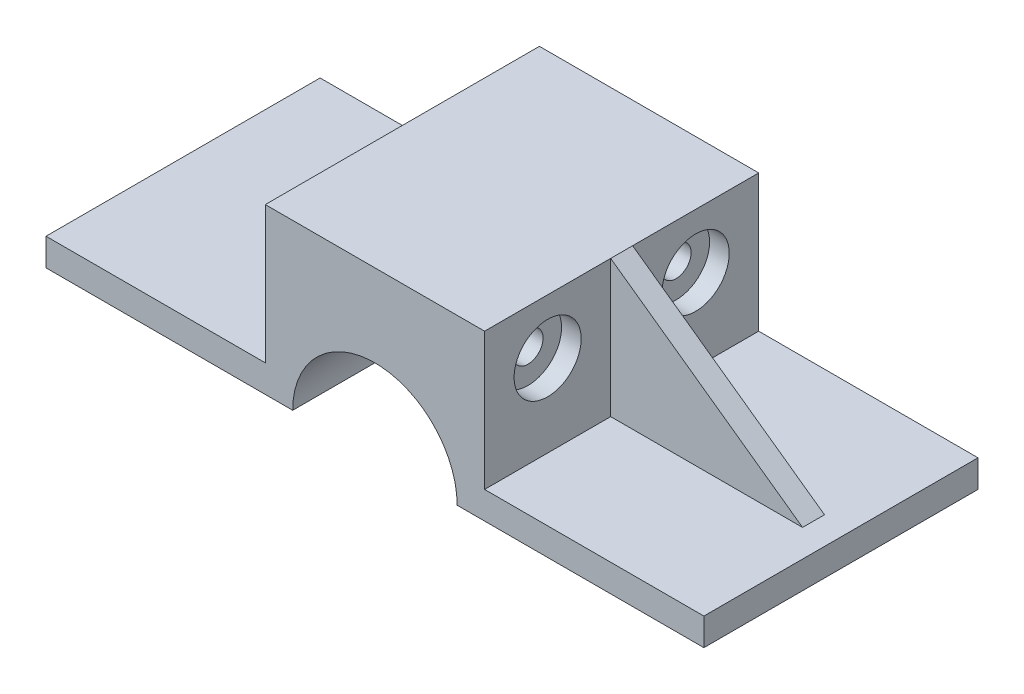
ISO-10303-21;
HEADER;
FILE_DESCRIPTION(('STEP AP214'),'2;1');
FILE_NAME('part.step','',(''),(''),'','','');
FILE_SCHEMA(('AUTOMOTIVE_DESIGN { 1 0 10303 214 1 1 1 1 }'));
ENDSEC;
DATA;
#1=APPLICATION_CONTEXT('core data for automotive mechanical design processes');
#2=APPLICATION_PROTOCOL_DEFINITION('international standard','automotive_design',2000,#1);
#3=PRODUCT_CONTEXT('',#1,'mechanical');
#4=PRODUCT('Part','Part','',(#3));
#5=PRODUCT_RELATED_PRODUCT_CATEGORY('part','',(#4));
#6=PRODUCT_DEFINITION_FORMATION('','',#4);
#7=PRODUCT_DEFINITION_CONTEXT('part definition',#1,'design');
#8=PRODUCT_DEFINITION('design','',#6,#7);
#9=PRODUCT_DEFINITION_SHAPE('','',#8);
#10=(LENGTH_UNIT() NAMED_UNIT(*) SI_UNIT(.MILLI.,.METRE.));
#11=(NAMED_UNIT(*) PLANE_ANGLE_UNIT() SI_UNIT($,.RADIAN.));
#12=(NAMED_UNIT(*) SI_UNIT($,.STERADIAN.) SOLID_ANGLE_UNIT());
#13=UNCERTAINTY_MEASURE_WITH_UNIT(LENGTH_MEASURE(1.E-05),#10,'distance_accuracy_value','');
#14=(GEOMETRIC_REPRESENTATION_CONTEXT(3) GLOBAL_UNCERTAINTY_ASSIGNED_CONTEXT((#13)) GLOBAL_UNIT_ASSIGNED_CONTEXT((#10,
#11,#12)) REPRESENTATION_CONTEXT('',''));
#15=CARTESIAN_POINT('',(0.,0.,0.));
#16=DIRECTION('',(0.,0.,1.));
#17=DIRECTION('',(1.,0.,0.));
#18=AXIS2_PLACEMENT_3D('',#15,#16,#17);
#19=CARTESIAN_POINT('',(20.,5.,25.));
#20=DIRECTION('',(-1.,0.,0.));
#21=DIRECTION('',(0.,-1.,0.));
#22=AXIS2_PLACEMENT_3D('',#19,#20,#21);
#23=PLANE('',#22);
#24=CARTESIAN_POINT('',(20.,20.,-13.5));
#25=DIRECTION('',(1.,0.,0.));
#26=DIRECTION('',(0.,0.,-1.));
#27=AXIS2_PLACEMENT_3D('',#24,#25,#26);
#28=CIRCLE('',#27,6.12);
#29=CARTESIAN_POINT('',(20.,20.,-19.62));
#30=VERTEX_POINT('',#29);
#31=EDGE_CURVE('E263',#30,#30,#28,.T.);
#32=ORIENTED_EDGE('',*,*,#31,.F.);
#33=EDGE_LOOP('',(#32));
#34=FACE_BOUND('',#33,.T.);
#35=DIRECTION('',(0.,1.,0.));
#36=VECTOR('',#35,1.);
#37=CARTESIAN_POINT('',(20.,5.,-2.));
#38=LINE('',#37,#36);
#39=CARTESIAN_POINT('',(20.,5.,-2.));
#40=VERTEX_POINT('',#39);
#41=CARTESIAN_POINT('',(20.,30.,-2.));
#42=VERTEX_POINT('',#41);
#43=EDGE_CURVE('E248',#40,#42,#38,.T.);
#44=ORIENTED_EDGE('',*,*,#43,.F.);
#45=DIRECTION('',(0.,0.,-1.));
#46=VECTOR('',#45,1.);
#47=CARTESIAN_POINT('',(20.,5.,25.));
#48=LINE('',#47,#46);
#49=CARTESIAN_POINT('',(20.,5.,-25.));
#50=VERTEX_POINT('',#49);
#51=EDGE_CURVE('E186',#40,#50,#48,.T.);
#52=ORIENTED_EDGE('',*,*,#51,.T.);
#53=DIRECTION('',(0.,1.,0.));
#54=VECTOR('',#53,1.);
#55=CARTESIAN_POINT('',(20.,5.,-25.));
#56=LINE('',#55,#54);
#57=CARTESIAN_POINT('',(20.,30.,-25.));
#58=VERTEX_POINT('',#57);
#59=EDGE_CURVE('E162',#50,#58,#56,.T.);
#60=ORIENTED_EDGE('',*,*,#59,.T.);
#61=DIRECTION('',(0.,0.,-1.));
#62=VECTOR('',#61,1.);
#63=CARTESIAN_POINT('',(20.,30.,25.));
#64=LINE('',#63,#62);
#65=EDGE_CURVE('E182',#42,#58,#64,.T.);
#66=ORIENTED_EDGE('',*,*,#65,.F.);
#67=EDGE_LOOP('',(#44,#52,#60,#66));
#68=FACE_BOUND('',#67,.T.);
#69=ADVANCED_FACE('F33',(#34,#68),#23,.F.);
#70=CARTESIAN_POINT('',(0.,0.,25.));
#71=DIRECTION('',(0.,0.,-1.));
#72=DIRECTION('',(-1.,0.,0.));
#73=AXIS2_PLACEMENT_3D('',#70,#71,#72);
#74=CYLINDRICAL_SURFACE('',#73,15.);
#75=DIRECTION('',(0.,0.,-1.));
#76=VECTOR('',#75,1.);
#77=CARTESIAN_POINT('',(-15.,0.,25.));
#78=LINE('',#77,#76);
#79=CARTESIAN_POINT('',(-15.,0.,25.));
#80=VERTEX_POINT('',#79);
#81=CARTESIAN_POINT('',(-15.,0.,-25.));
#82=VERTEX_POINT('',#81);
#83=EDGE_CURVE('E95',#80,#82,#78,.T.);
#84=ORIENTED_EDGE('',*,*,#83,.T.);
#85=CARTESIAN_POINT('',(0.,0.,-25.));
#86=DIRECTION('',(0.,0.,-1.));
#87=DIRECTION('',(-1.,0.,0.));
#88=AXIS2_PLACEMENT_3D('',#85,#86,#87);
#89=CIRCLE('',#88,15.);
#90=CARTESIAN_POINT('',(15.,0.,-25.));
#91=VERTEX_POINT('',#90);
#92=EDGE_CURVE('E151',#82,#91,#89,.T.);
#93=ORIENTED_EDGE('',*,*,#92,.T.);
#94=DIRECTION('',(0.,0.,-1.));
#95=VECTOR('',#94,1.);
#96=CARTESIAN_POINT('',(15.,0.,25.));
#97=LINE('',#96,#95);
#98=CARTESIAN_POINT('',(15.,0.,25.));
#99=VERTEX_POINT('',#98);
#100=EDGE_CURVE('E11',#99,#91,#97,.T.);
#101=ORIENTED_EDGE('',*,*,#100,.F.);
#102=CARTESIAN_POINT('',(0.,0.,25.));
#103=DIRECTION('',(0.,0.,-1.));
#104=DIRECTION('',(-1.,0.,0.));
#105=AXIS2_PLACEMENT_3D('',#102,#103,#104);
#106=CIRCLE('',#105,15.);
#107=EDGE_CURVE('E176',#80,#99,#106,.T.);
#108=ORIENTED_EDGE('',*,*,#107,.F.);
#109=EDGE_LOOP('',(#84,#93,#101,#108));
#110=FACE_BOUND('',#109,.T.);
#111=ADVANCED_FACE('F35',(#110),#74,.F.);
#112=CARTESIAN_POINT('',(60.,0.,25.));
#113=DIRECTION('',(0.,1.,0.));
#114=DIRECTION('',(-1.,0.,0.));
#115=AXIS2_PLACEMENT_3D('',#112,#113,#114);
#116=PLANE('',#115);
#117=ORIENTED_EDGE('',*,*,#100,.T.);
#118=DIRECTION('',(1.,0.,0.));
#119=VECTOR('',#118,1.);
#120=CARTESIAN_POINT('',(60.,0.,-25.));
#121=LINE('',#120,#119);
#122=CARTESIAN_POINT('',(60.,0.,-25.));
#123=VERTEX_POINT('',#122);
#124=EDGE_CURVE('E153',#91,#123,#121,.T.);
#125=ORIENTED_EDGE('',*,*,#124,.T.);
#126=DIRECTION('',(0.,0.,-1.));
#127=VECTOR('',#126,1.);
#128=CARTESIAN_POINT('',(60.,0.,25.));
#129=LINE('',#128,#127);
#130=CARTESIAN_POINT('',(60.,0.,25.));
#131=VERTEX_POINT('',#130);
#132=EDGE_CURVE('E41',#131,#123,#129,.T.);
#133=ORIENTED_EDGE('',*,*,#132,.F.);
#134=DIRECTION('',(1.,0.,0.));
#135=VECTOR('',#134,1.);
#136=CARTESIAN_POINT('',(60.,0.,25.));
#137=LINE('',#136,#135);
#138=EDGE_CURVE('E103',#99,#131,#137,.T.);
#139=ORIENTED_EDGE('',*,*,#138,.F.);
#140=EDGE_LOOP('',(#117,#125,#133,#139));
#141=FACE_BOUND('',#140,.T.);
#142=ADVANCED_FACE('F200',(#141),#116,.F.);
#143=CARTESIAN_POINT('',(60.,0.,25.));
#144=DIRECTION('',(-1.,0.,0.));
#145=DIRECTION('',(0.,0.,1.));
#146=AXIS2_PLACEMENT_3D('',#143,#144,#145);
#147=PLANE('',#146);
#148=ORIENTED_EDGE('',*,*,#132,.T.);
#149=DIRECTION('',(0.,1.,0.));
#150=VECTOR('',#149,1.);
#151=CARTESIAN_POINT('',(60.,0.,-25.));
#152=LINE('',#151,#150);
#153=CARTESIAN_POINT('',(60.,5.00000000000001,-25.));
#154=VERTEX_POINT('',#153);
#155=EDGE_CURVE('E157',#123,#154,#152,.T.);
#156=ORIENTED_EDGE('',*,*,#155,.T.);
#157=DIRECTION('',(0.,0.,-1.));
#158=VECTOR('',#157,1.);
#159=CARTESIAN_POINT('',(60.,5.00000000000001,25.));
#160=LINE('',#159,#158);
#161=CARTESIAN_POINT('',(60.,5.00000000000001,25.));
#162=VERTEX_POINT('',#161);
#163=EDGE_CURVE('E191',#162,#154,#160,.T.);
#164=ORIENTED_EDGE('',*,*,#163,.F.);
#165=DIRECTION('',(0.,1.,0.));
#166=VECTOR('',#165,1.);
#167=CARTESIAN_POINT('',(60.,0.,25.));
#168=LINE('',#167,#166);
#169=EDGE_CURVE('E198',#131,#162,#168,.T.);
#170=ORIENTED_EDGE('',*,*,#169,.F.);
#171=EDGE_LOOP('',(#148,#156,#164,#170));
#172=FACE_BOUND('',#171,.T.);
#173=ADVANCED_FACE('F195',(#172),#147,.F.);
#174=CARTESIAN_POINT('',(60.,5.00000000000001,25.));
#175=DIRECTION('',(0.,-1.,0.));
#176=DIRECTION('',(1.,0.,0.));
#177=AXIS2_PLACEMENT_3D('',#174,#175,#176);
#178=PLANE('',#177);
#179=DIRECTION('',(0.,0.,-1.));
#180=VECTOR('',#179,1.);
#181=CARTESIAN_POINT('',(55.,5.00000000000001,25.));
#182=LINE('',#181,#180);
#183=CARTESIAN_POINT('',(55.,5.00000000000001,-2.));
#184=VERTEX_POINT('',#183);
#185=CARTESIAN_POINT('',(55.,5.00000000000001,2.));
#186=VERTEX_POINT('',#185);
#187=EDGE_CURVE('E154',#184,#186,#182,.F.);
#188=ORIENTED_EDGE('',*,*,#187,.T.);
#189=DIRECTION('',(-1.,0.,0.));
#190=VECTOR('',#189,1.);
#191=CARTESIAN_POINT('',(60.,5.00000000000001,2.));
#192=LINE('',#191,#190);
#193=CARTESIAN_POINT('',(20.,5.,2.));
#194=VERTEX_POINT('',#193);
#195=EDGE_CURVE('E240',#186,#194,#192,.T.);
#196=ORIENTED_EDGE('',*,*,#195,.T.);
#197=CARTESIAN_POINT('',(20.,5.,25.));
#198=VERTEX_POINT('',#197);
#199=EDGE_CURVE('E188',#198,#194,#48,.T.);
#200=ORIENTED_EDGE('',*,*,#199,.F.);
#201=DIRECTION('',(-1.,0.,0.));
#202=VECTOR('',#201,1.);
#203=CARTESIAN_POINT('',(60.,5.00000000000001,25.));
#204=LINE('',#203,#202);
#205=EDGE_CURVE('E216',#162,#198,#204,.T.);
#206=ORIENTED_EDGE('',*,*,#205,.F.);
#207=ORIENTED_EDGE('',*,*,#163,.T.);
#208=DIRECTION('',(-1.,0.,0.));
#209=VECTOR('',#208,1.);
#210=CARTESIAN_POINT('',(60.,5.00000000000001,-25.));
#211=LINE('',#210,#209);
#212=EDGE_CURVE('E159',#154,#50,#211,.T.);
#213=ORIENTED_EDGE('',*,*,#212,.T.);
#214=ORIENTED_EDGE('',*,*,#51,.F.);
#215=DIRECTION('',(-1.,0.,0.));
#216=VECTOR('',#215,1.);
#217=CARTESIAN_POINT('',(60.,5.00000000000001,-2.));
#218=LINE('',#217,#216);
#219=EDGE_CURVE('E245',#184,#40,#218,.T.);
#220=ORIENTED_EDGE('',*,*,#219,.F.);
#221=EDGE_LOOP('',(#188,#196,#200,#206,#207,#213,#214,#220));
#222=FACE_BOUND('',#221,.T.);
#223=ADVANCED_FACE('F211',(#222),#178,.F.);
#224=CARTESIAN_POINT('',(20.,20.,13.5));
#225=DIRECTION('',(1.,0.,0.));
#226=DIRECTION('',(0.,0.,-1.));
#227=AXIS2_PLACEMENT_3D('',#224,#225,#226);
#228=CIRCLE('',#227,6.12);
#229=CARTESIAN_POINT('',(20.,20.,7.38));
#230=VERTEX_POINT('',#229);
#231=EDGE_CURVE('E275',#230,#230,#228,.T.);
#232=ORIENTED_EDGE('',*,*,#231,.F.);
#233=EDGE_LOOP('',(#232));
#234=FACE_BOUND('',#233,.T.);
#235=ORIENTED_EDGE('',*,*,#199,.T.);
#236=DIRECTION('',(0.,1.,0.));
#237=VECTOR('',#236,1.);
#238=CARTESIAN_POINT('',(20.,5.,2.));
#239=LINE('',#238,#237);
#240=CARTESIAN_POINT('',(20.,30.,2.));
#241=VERTEX_POINT('',#240);
#242=EDGE_CURVE('E242',#194,#241,#239,.T.);
#243=ORIENTED_EDGE('',*,*,#242,.T.);
#244=CARTESIAN_POINT('',(20.,30.,25.));
#245=VERTEX_POINT('',#244);
#246=EDGE_CURVE('E183',#245,#241,#64,.T.);
#247=ORIENTED_EDGE('',*,*,#246,.F.);
#248=DIRECTION('',(0.,1.,0.));
#249=VECTOR('',#248,1.);
#250=CARTESIAN_POINT('',(20.,5.,25.));
#251=LINE('',#250,#249);
#252=EDGE_CURVE('E219',#198,#245,#251,.T.);
#253=ORIENTED_EDGE('',*,*,#252,.F.);
#254=EDGE_LOOP('',(#235,#243,#247,#253));
#255=FACE_BOUND('',#254,.T.);
#256=ADVANCED_FACE('F281',(#234,#255),#23,.F.);
#257=CARTESIAN_POINT('',(-20.,30.,25.));
#258=DIRECTION('',(0.,-1.,0.));
#259=DIRECTION('',(1.,0.,0.));
#260=AXIS2_PLACEMENT_3D('',#257,#258,#259);
#261=PLANE('',#260);
#262=ORIENTED_EDGE('',*,*,#246,.T.);
#263=EDGE_CURVE('E187',#241,#42,#64,.T.);
#264=ORIENTED_EDGE('',*,*,#263,.T.);
#265=ORIENTED_EDGE('',*,*,#65,.T.);
#266=DIRECTION('',(-1.,0.,0.));
#267=VECTOR('',#266,1.);
#268=CARTESIAN_POINT('',(-20.,30.,-25.));
#269=LINE('',#268,#267);
#270=CARTESIAN_POINT('',(-20.,30.,-25.));
#271=VERTEX_POINT('',#270);
#272=EDGE_CURVE('E165',#58,#271,#269,.T.);
#273=ORIENTED_EDGE('',*,*,#272,.T.);
#274=DIRECTION('',(0.,0.,-1.));
#275=VECTOR('',#274,1.);
#276=CARTESIAN_POINT('',(-20.,30.,25.));
#277=LINE('',#276,#275);
#278=CARTESIAN_POINT('',(-20.,30.,25.));
#279=VERTEX_POINT('',#278);
#280=EDGE_CURVE('E180',#279,#271,#277,.T.);
#281=ORIENTED_EDGE('',*,*,#280,.F.);
#282=DIRECTION('',(-1.,0.,0.));
#283=VECTOR('',#282,1.);
#284=CARTESIAN_POINT('',(-20.,30.,25.));
#285=LINE('',#284,#283);
#286=EDGE_CURVE('E221',#245,#279,#285,.T.);
#287=ORIENTED_EDGE('',*,*,#286,.F.);
#288=EDGE_LOOP('',(#262,#264,#265,#273,#281,#287));
#289=FACE_BOUND('',#288,.T.);
#290=ADVANCED_FACE('F230',(#289),#261,.F.);
#291=CARTESIAN_POINT('',(-20.,5.,25.));
#292=DIRECTION('',(1.,0.,0.));
#293=DIRECTION('',(0.,1.,0.));
#294=AXIS2_PLACEMENT_3D('',#291,#292,#293);
#295=PLANE('',#294);
#296=ORIENTED_EDGE('',*,*,#280,.T.);
#297=DIRECTION('',(0.,-1.,0.));
#298=VECTOR('',#297,1.);
#299=CARTESIAN_POINT('',(-20.,5.,-25.));
#300=LINE('',#299,#298);
#301=CARTESIAN_POINT('',(-20.,5.,-25.));
#302=VERTEX_POINT('',#301);
#303=EDGE_CURVE('E168',#271,#302,#300,.T.);
#304=ORIENTED_EDGE('',*,*,#303,.T.);
#305=DIRECTION('',(0.,0.,-1.));
#306=VECTOR('',#305,1.);
#307=CARTESIAN_POINT('',(-20.,5.,25.));
#308=LINE('',#307,#306);
#309=CARTESIAN_POINT('',(-20.,5.,25.));
#310=VERTEX_POINT('',#309);
#311=EDGE_CURVE('E143',#310,#302,#308,.T.);
#312=ORIENTED_EDGE('',*,*,#311,.F.);
#313=DIRECTION('',(0.,-1.,0.));
#314=VECTOR('',#313,1.);
#315=CARTESIAN_POINT('',(-20.,5.,25.));
#316=LINE('',#315,#314);
#317=EDGE_CURVE('E131',#279,#310,#316,.T.);
#318=ORIENTED_EDGE('',*,*,#317,.F.);
#319=EDGE_LOOP('',(#296,#304,#312,#318));
#320=FACE_BOUND('',#319,.T.);
#321=ADVANCED_FACE('F233',(#320),#295,.F.);
#322=CARTESIAN_POINT('',(-60.,5.,25.));
#323=DIRECTION('',(0.,-1.,0.));
#324=DIRECTION('',(0.,0.,-1.));
#325=AXIS2_PLACEMENT_3D('',#322,#323,#324);
#326=PLANE('',#325);
#327=ORIENTED_EDGE('',*,*,#311,.T.);
#328=DIRECTION('',(-1.,0.,0.));
#329=VECTOR('',#328,1.);
#330=CARTESIAN_POINT('',(-60.,5.,-25.));
#331=LINE('',#330,#329);
#332=CARTESIAN_POINT('',(-60.,5.,-25.));
#333=VERTEX_POINT('',#332);
#334=EDGE_CURVE('E139',#302,#333,#331,.T.);
#335=ORIENTED_EDGE('',*,*,#334,.T.);
#336=DIRECTION('',(0.,0.,-1.));
#337=VECTOR('',#336,1.);
#338=CARTESIAN_POINT('',(-60.,5.,25.));
#339=LINE('',#338,#337);
#340=CARTESIAN_POINT('',(-60.,5.,25.));
#341=VERTEX_POINT('',#340);
#342=EDGE_CURVE('E136',#341,#333,#339,.T.);
#343=ORIENTED_EDGE('',*,*,#342,.F.);
#344=DIRECTION('',(-1.,0.,0.));
#345=VECTOR('',#344,1.);
#346=CARTESIAN_POINT('',(-60.,5.,25.));
#347=LINE('',#346,#345);
#348=EDGE_CURVE('E124',#310,#341,#347,.T.);
#349=ORIENTED_EDGE('',*,*,#348,.F.);
#350=EDGE_LOOP('',(#327,#335,#343,#349));
#351=FACE_BOUND('',#350,.T.);
#352=ADVANCED_FACE('F137',(#351),#326,.F.);
#353=CARTESIAN_POINT('',(-60.,0.,25.));
#354=DIRECTION('',(1.,0.,0.));
#355=DIRECTION('',(0.,0.,-1.));
#356=AXIS2_PLACEMENT_3D('',#353,#354,#355);
#357=PLANE('',#356);
#358=ORIENTED_EDGE('',*,*,#342,.T.);
#359=DIRECTION('',(0.,-1.,0.));
#360=VECTOR('',#359,1.);
#361=CARTESIAN_POINT('',(-60.,0.,-25.));
#362=LINE('',#361,#360);
#363=CARTESIAN_POINT('',(-60.,0.,-25.));
#364=VERTEX_POINT('',#363);
#365=EDGE_CURVE('E172',#333,#364,#362,.T.);
#366=ORIENTED_EDGE('',*,*,#365,.T.);
#367=DIRECTION('',(0.,0.,-1.));
#368=VECTOR('',#367,1.);
#369=CARTESIAN_POINT('',(-60.,0.,25.));
#370=LINE('',#369,#368);
#371=CARTESIAN_POINT('',(-60.,0.,25.));
#372=VERTEX_POINT('',#371);
#373=EDGE_CURVE('E144',#372,#364,#370,.T.);
#374=ORIENTED_EDGE('',*,*,#373,.F.);
#375=DIRECTION('',(0.,-1.,0.));
#376=VECTOR('',#375,1.);
#377=CARTESIAN_POINT('',(-60.,0.,25.));
#378=LINE('',#377,#376);
#379=EDGE_CURVE('E128',#341,#372,#378,.T.);
#380=ORIENTED_EDGE('',*,*,#379,.F.);
#381=EDGE_LOOP('',(#358,#366,#374,#380));
#382=FACE_BOUND('',#381,.T.);
#383=ADVANCED_FACE('F146',(#382),#357,.F.);
#384=CARTESIAN_POINT('',(-60.,0.,25.));
#385=DIRECTION('',(0.,1.,0.));
#386=DIRECTION('',(0.,0.,1.));
#387=AXIS2_PLACEMENT_3D('',#384,#385,#386);
#388=PLANE('',#387);
#389=ORIENTED_EDGE('',*,*,#373,.T.);
#390=DIRECTION('',(1.,0.,0.));
#391=VECTOR('',#390,1.);
#392=CARTESIAN_POINT('',(-60.,0.,-25.));
#393=LINE('',#392,#391);
#394=EDGE_CURVE('E174',#364,#82,#393,.T.);
#395=ORIENTED_EDGE('',*,*,#394,.T.);
#396=ORIENTED_EDGE('',*,*,#83,.F.);
#397=DIRECTION('',(1.,0.,0.));
#398=VECTOR('',#397,1.);
#399=CARTESIAN_POINT('',(-60.,0.,25.));
#400=LINE('',#399,#398);
#401=EDGE_CURVE('E57',#372,#80,#400,.T.);
#402=ORIENTED_EDGE('',*,*,#401,.F.);
#403=EDGE_LOOP('',(#389,#395,#396,#402));
#404=FACE_BOUND('',#403,.T.);
#405=ADVANCED_FACE('F236',(#404),#388,.F.);
#406=CARTESIAN_POINT('',(0.,0.,25.));
#407=DIRECTION('',(0.,0.,-1.));
#408=DIRECTION('',(-1.,0.,0.));
#409=AXIS2_PLACEMENT_3D('',#406,#407,#408);
#410=PLANE('',#409);
#411=ORIENTED_EDGE('',*,*,#107,.T.);
#412=ORIENTED_EDGE('',*,*,#138,.T.);
#413=ORIENTED_EDGE('',*,*,#169,.T.);
#414=ORIENTED_EDGE('',*,*,#205,.T.);
#415=ORIENTED_EDGE('',*,*,#252,.T.);
#416=ORIENTED_EDGE('',*,*,#286,.T.);
#417=ORIENTED_EDGE('',*,*,#317,.T.);
#418=ORIENTED_EDGE('',*,*,#348,.T.);
#419=ORIENTED_EDGE('',*,*,#379,.T.);
#420=ORIENTED_EDGE('',*,*,#401,.T.);
#421=EDGE_LOOP('',(#411,#412,#413,#414,#415,#416,#417,#418,#419,#420));
#422=FACE_BOUND('',#421,.T.);
#423=ADVANCED_FACE('F126',(#422),#410,.F.);
#424=CARTESIAN_POINT('',(0.,0.,-25.));
#425=DIRECTION('',(0.,0.,-1.));
#426=DIRECTION('',(-1.,0.,0.));
#427=AXIS2_PLACEMENT_3D('',#424,#425,#426);
#428=PLANE('',#427);
#429=ORIENTED_EDGE('',*,*,#92,.F.);
#430=ORIENTED_EDGE('',*,*,#394,.F.);
#431=ORIENTED_EDGE('',*,*,#365,.F.);
#432=ORIENTED_EDGE('',*,*,#334,.F.);
#433=ORIENTED_EDGE('',*,*,#303,.F.);
#434=ORIENTED_EDGE('',*,*,#272,.F.);
#435=ORIENTED_EDGE('',*,*,#59,.F.);
#436=ORIENTED_EDGE('',*,*,#212,.F.);
#437=ORIENTED_EDGE('',*,*,#155,.F.);
#438=ORIENTED_EDGE('',*,*,#124,.F.);
#439=EDGE_LOOP('',(#429,#430,#431,#432,#433,#434,#435,#436,#437,#438));
#440=FACE_BOUND('',#439,.T.);
#441=ADVANCED_FACE('F205',(#440),#428,.T.);
#442=CARTESIAN_POINT('',(20.,30.,0.));
#443=DIRECTION('',(-0.581238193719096,-0.813733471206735,0.));
#444=DIRECTION('',(0.813733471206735,-0.581238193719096,0.));
#445=AXIS2_PLACEMENT_3D('',#442,#443,#444);
#446=PLANE('',#445);
#447=ORIENTED_EDGE('',*,*,#187,.F.);
#448=DIRECTION('',(0.813733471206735,-0.581238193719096,0.));
#449=VECTOR('',#448,1.);
#450=CARTESIAN_POINT('',(20.,30.,-2.));
#451=LINE('',#450,#449);
#452=EDGE_CURVE('E48',#42,#184,#451,.T.);
#453=ORIENTED_EDGE('',*,*,#452,.F.);
#454=ORIENTED_EDGE('',*,*,#263,.F.);
#455=DIRECTION('',(0.813733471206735,-0.581238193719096,0.));
#456=VECTOR('',#455,1.);
#457=CARTESIAN_POINT('',(20.,30.,2.));
#458=LINE('',#457,#456);
#459=EDGE_CURVE('E250',#241,#186,#458,.T.);
#460=ORIENTED_EDGE('',*,*,#459,.T.);
#461=EDGE_LOOP('',(#447,#453,#454,#460));
#462=FACE_BOUND('',#461,.T.);
#463=ADVANCED_FACE('F397',(#462),#446,.F.);
#464=CARTESIAN_POINT('',(0.,15.,2.));
#465=DIRECTION('',(0.,0.,1.));
#466=DIRECTION('',(1.,0.,0.));
#467=AXIS2_PLACEMENT_3D('',#464,#465,#466);
#468=PLANE('',#467);
#469=ORIENTED_EDGE('',*,*,#195,.F.);
#470=ORIENTED_EDGE('',*,*,#459,.F.);
#471=ORIENTED_EDGE('',*,*,#242,.F.);
#472=EDGE_LOOP('',(#469,#470,#471));
#473=FACE_BOUND('',#472,.T.);
#474=ADVANCED_FACE('F403',(#473),#468,.T.);
#475=CARTESIAN_POINT('',(0.,15.,-2.));
#476=DIRECTION('',(0.,0.,1.));
#477=DIRECTION('',(1.,0.,0.));
#478=AXIS2_PLACEMENT_3D('',#475,#476,#477);
#479=PLANE('',#478);
#480=ORIENTED_EDGE('',*,*,#452,.T.);
#481=ORIENTED_EDGE('',*,*,#219,.T.);
#482=ORIENTED_EDGE('',*,*,#43,.T.);
#483=EDGE_LOOP('',(#480,#481,#482));
#484=FACE_BOUND('',#483,.T.);
#485=ADVANCED_FACE('F410',(#484),#479,.F.);
#486=CARTESIAN_POINT('',(10.,20.,-13.5));
#487=DIRECTION('',(1.,0.,0.));
#488=DIRECTION('',(0.,0.,-1.));
#489=AXIS2_PLACEMENT_3D('',#486,#487,#488);
#490=CONICAL_SURFACE('',#489,2.75,1.02974425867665);
#491=CARTESIAN_POINT('',(8.34763329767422,20.,-13.5));
#492=VERTEX_POINT('',#491);
#493=VERTEX_LOOP('',#492);
#494=FACE_BOUND('',#493,.T.);
#495=CARTESIAN_POINT('',(10.,20.,-13.5));
#496=DIRECTION('',(1.,0.,0.));
#497=DIRECTION('',(0.,0.,-1.));
#498=AXIS2_PLACEMENT_3D('',#495,#496,#497);
#499=CIRCLE('',#498,2.75);
#500=CARTESIAN_POINT('',(10.,20.,-16.25));
#501=VERTEX_POINT('',#500);
#502=EDGE_CURVE('E252',#501,#501,#499,.T.);
#503=ORIENTED_EDGE('',*,*,#502,.T.);
#504=EDGE_LOOP('',(#503));
#505=FACE_BOUND('',#504,.T.);
#506=ADVANCED_FACE('F417',(#494,#505),#490,.F.);
#507=CARTESIAN_POINT('',(20.,20.,-13.5));
#508=DIRECTION('',(1.,0.,0.));
#509=DIRECTION('',(0.,0.,-1.));
#510=AXIS2_PLACEMENT_3D('',#507,#508,#509);
#511=CYLINDRICAL_SURFACE('',#510,2.75);
#512=ORIENTED_EDGE('',*,*,#502,.F.);
#513=EDGE_LOOP('',(#512));
#514=FACE_BOUND('',#513,.T.);
#515=CARTESIAN_POINT('',(16.42,20.,-13.5));
#516=DIRECTION('',(1.,0.,0.));
#517=DIRECTION('',(0.,0.,-1.));
#518=AXIS2_PLACEMENT_3D('',#515,#516,#517);
#519=CIRCLE('',#518,2.75);
#520=CARTESIAN_POINT('',(16.42,20.,-16.25));
#521=VERTEX_POINT('',#520);
#522=EDGE_CURVE('E257',#521,#521,#519,.T.);
#523=ORIENTED_EDGE('',*,*,#522,.T.);
#524=EDGE_LOOP('',(#523));
#525=FACE_BOUND('',#524,.T.);
#526=ADVANCED_FACE('F424',(#514,#525),#511,.F.);
#527=CARTESIAN_POINT('',(16.42,22.75,-13.5));
#528=DIRECTION('',(-1.,0.,0.));
#529=DIRECTION('',(0.,0.,1.));
#530=AXIS2_PLACEMENT_3D('',#527,#528,#529);
#531=PLANE('',#530);
#532=ORIENTED_EDGE('',*,*,#522,.F.);
#533=EDGE_LOOP('',(#532));
#534=FACE_BOUND('',#533,.T.);
#535=CARTESIAN_POINT('',(16.42,20.,-13.5));
#536=DIRECTION('',(1.,0.,0.));
#537=DIRECTION('',(0.,0.,-1.));
#538=AXIS2_PLACEMENT_3D('',#535,#536,#537);
#539=CIRCLE('',#538,6.12);
#540=CARTESIAN_POINT('',(16.42,20.,-19.62));
#541=VERTEX_POINT('',#540);
#542=EDGE_CURVE('E260',#541,#541,#539,.T.);
#543=ORIENTED_EDGE('',*,*,#542,.T.);
#544=EDGE_LOOP('',(#543));
#545=FACE_BOUND('',#544,.T.);
#546=ADVANCED_FACE('F432',(#534,#545),#531,.F.);
#547=CARTESIAN_POINT('',(20.,20.,-13.5));
#548=DIRECTION('',(1.,0.,0.));
#549=DIRECTION('',(0.,0.,-1.));
#550=AXIS2_PLACEMENT_3D('',#547,#548,#549);
#551=CYLINDRICAL_SURFACE('',#550,6.12);
#552=ORIENTED_EDGE('',*,*,#542,.F.);
#553=EDGE_LOOP('',(#552));
#554=FACE_BOUND('',#553,.T.);
#555=ORIENTED_EDGE('',*,*,#31,.T.);
#556=EDGE_LOOP('',(#555));
#557=FACE_BOUND('',#556,.T.);
#558=ADVANCED_FACE('F306',(#554,#557),#551,.F.);
#559=CARTESIAN_POINT('',(10.,20.,13.5));
#560=DIRECTION('',(1.,0.,0.));
#561=DIRECTION('',(0.,0.,-1.));
#562=AXIS2_PLACEMENT_3D('',#559,#560,#561);
#563=CONICAL_SURFACE('',#562,2.75,1.02974425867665);
#564=CARTESIAN_POINT('',(8.34763329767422,20.,13.5));
#565=VERTEX_POINT('',#564);
#566=VERTEX_LOOP('',#565);
#567=FACE_BOUND('',#566,.T.);
#568=CARTESIAN_POINT('',(10.,20.,13.5));
#569=DIRECTION('',(1.,0.,0.));
#570=DIRECTION('',(0.,0.,-1.));
#571=AXIS2_PLACEMENT_3D('',#568,#569,#570);
#572=CIRCLE('',#571,2.75);
#573=CARTESIAN_POINT('',(10.,20.,10.75));
#574=VERTEX_POINT('',#573);
#575=EDGE_CURVE('E266',#574,#574,#572,.T.);
#576=ORIENTED_EDGE('',*,*,#575,.T.);
#577=EDGE_LOOP('',(#576));
#578=FACE_BOUND('',#577,.T.);
#579=ADVANCED_FACE('F302',(#567,#578),#563,.F.);
#580=CARTESIAN_POINT('',(20.,20.,13.5));
#581=DIRECTION('',(1.,0.,0.));
#582=DIRECTION('',(0.,0.,-1.));
#583=AXIS2_PLACEMENT_3D('',#580,#581,#582);
#584=CYLINDRICAL_SURFACE('',#583,2.75);
#585=ORIENTED_EDGE('',*,*,#575,.F.);
#586=EDGE_LOOP('',(#585));
#587=FACE_BOUND('',#586,.T.);
#588=CARTESIAN_POINT('',(16.42,20.,13.5));
#589=DIRECTION('',(1.,0.,0.));
#590=DIRECTION('',(0.,0.,-1.));
#591=AXIS2_PLACEMENT_3D('',#588,#589,#590);
#592=CIRCLE('',#591,2.75);
#593=CARTESIAN_POINT('',(16.42,20.,10.75));
#594=VERTEX_POINT('',#593);
#595=EDGE_CURVE('E269',#594,#594,#592,.T.);
#596=ORIENTED_EDGE('',*,*,#595,.T.);
#597=EDGE_LOOP('',(#596));
#598=FACE_BOUND('',#597,.T.);
#599=ADVANCED_FACE('F305',(#587,#598),#584,.F.);
#600=CARTESIAN_POINT('',(16.42,22.75,13.5));
#601=DIRECTION('',(-1.,0.,0.));
#602=DIRECTION('',(0.,0.,1.));
#603=AXIS2_PLACEMENT_3D('',#600,#601,#602);
#604=PLANE('',#603);
#605=ORIENTED_EDGE('',*,*,#595,.F.);
#606=EDGE_LOOP('',(#605));
#607=FACE_BOUND('',#606,.T.);
#608=CARTESIAN_POINT('',(16.42,20.,13.5));
#609=DIRECTION('',(1.,0.,0.));
#610=DIRECTION('',(0.,0.,-1.));
#611=AXIS2_PLACEMENT_3D('',#608,#609,#610);
#612=CIRCLE('',#611,6.12);
#613=CARTESIAN_POINT('',(16.42,20.,7.38));
#614=VERTEX_POINT('',#613);
#615=EDGE_CURVE('E272',#614,#614,#612,.T.);
#616=ORIENTED_EDGE('',*,*,#615,.T.);
#617=EDGE_LOOP('',(#616));
#618=FACE_BOUND('',#617,.T.);
#619=ADVANCED_FACE('F312',(#607,#618),#604,.F.);
#620=CARTESIAN_POINT('',(20.,20.,13.5));
#621=DIRECTION('',(1.,0.,0.));
#622=DIRECTION('',(0.,0.,-1.));
#623=AXIS2_PLACEMENT_3D('',#620,#621,#622);
#624=CYLINDRICAL_SURFACE('',#623,6.12);
#625=ORIENTED_EDGE('',*,*,#615,.F.);
#626=EDGE_LOOP('',(#625));
#627=FACE_BOUND('',#626,.T.);
#628=ORIENTED_EDGE('',*,*,#231,.T.);
#629=EDGE_LOOP('',(#628));
#630=FACE_BOUND('',#629,.T.);
#631=ADVANCED_FACE('F279',(#627,#630),#624,.F.);
#632=CLOSED_SHELL('',(#69,#111,#142,#173,#223,#256,#290,#321,#352,#383,#405,#423,#441,#463,#474,
#485,#506,#526,#546,#558,#579,#599,#619,#631));
#633=MANIFOLD_SOLID_BREP('B2',#632);
#634=ADVANCED_BREP_SHAPE_REPRESENTATION('',(#18,#633),#14);
#635=SHAPE_DEFINITION_REPRESENTATION(#9,#634);
ENDSEC;
END-ISO-10303-21;
